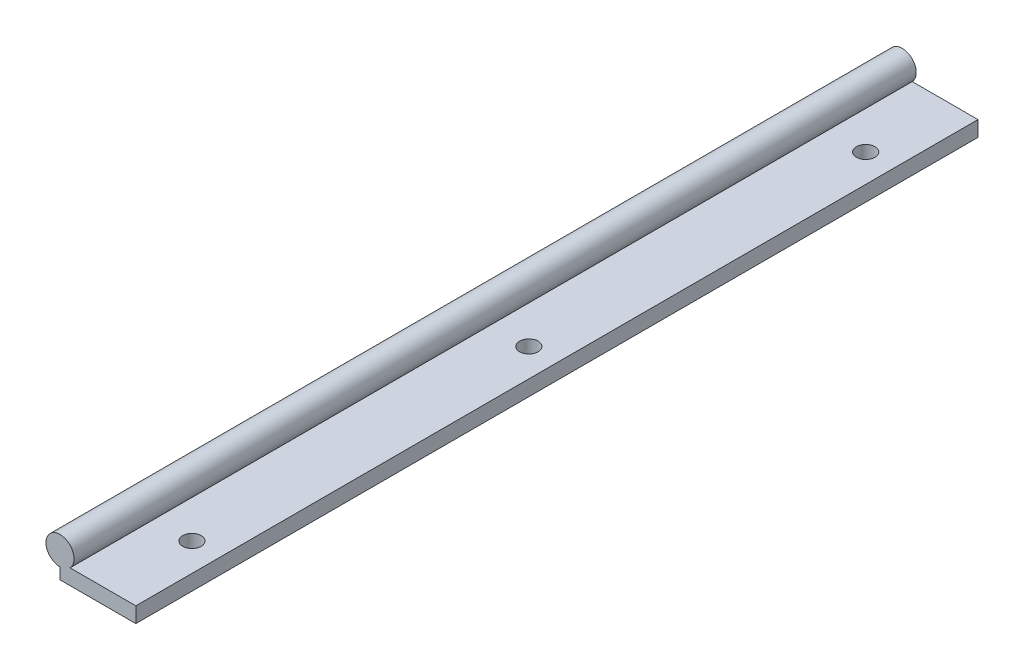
ISO-10303-21;
HEADER;
FILE_DESCRIPTION(('STEP AP214'),'2;1');
FILE_NAME('part.step','',(''),(''),'','','');
FILE_SCHEMA(('AUTOMOTIVE_DESIGN { 1 0 10303 214 1 1 1 1 }'));
ENDSEC;
DATA;
#1=APPLICATION_CONTEXT('core data for automotive mechanical design processes');
#2=APPLICATION_PROTOCOL_DEFINITION('international standard','automotive_design',2000,#1);
#3=PRODUCT_CONTEXT('',#1,'mechanical');
#4=PRODUCT('Part','Part','',(#3));
#5=PRODUCT_RELATED_PRODUCT_CATEGORY('part','',(#4));
#6=PRODUCT_DEFINITION_FORMATION('','',#4);
#7=PRODUCT_DEFINITION_CONTEXT('part definition',#1,'design');
#8=PRODUCT_DEFINITION('design','',#6,#7);
#9=PRODUCT_DEFINITION_SHAPE('','',#8);
#10=(LENGTH_UNIT() NAMED_UNIT(*) SI_UNIT(.MILLI.,.METRE.));
#11=(NAMED_UNIT(*) PLANE_ANGLE_UNIT() SI_UNIT($,.RADIAN.));
#12=(NAMED_UNIT(*) SI_UNIT($,.STERADIAN.) SOLID_ANGLE_UNIT());
#13=UNCERTAINTY_MEASURE_WITH_UNIT(LENGTH_MEASURE(1.E-05),#10,'distance_accuracy_value','');
#14=(GEOMETRIC_REPRESENTATION_CONTEXT(3) GLOBAL_UNCERTAINTY_ASSIGNED_CONTEXT((#13)) GLOBAL_UNIT_ASSIGNED_CONTEXT((#10,
#11,#12)) REPRESENTATION_CONTEXT('',''));
#15=CARTESIAN_POINT('',(0.,0.,0.));
#16=DIRECTION('',(0.,0.,1.));
#17=DIRECTION('',(1.,0.,0.));
#18=AXIS2_PLACEMENT_3D('',#15,#16,#17);
#19=CARTESIAN_POINT('',(13.5,2.75,300.));
#20=DIRECTION('',(-1.,0.,0.));
#21=DIRECTION('',(0.,0.,1.));
#22=AXIS2_PLACEMENT_3D('',#19,#20,#21);
#23=PLANE('',#22);
#24=DIRECTION('',(0.,1.,0.));
#25=VECTOR('',#24,1.);
#26=CARTESIAN_POINT('',(13.5,2.75,0.));
#27=LINE('',#26,#25);
#28=CARTESIAN_POINT('',(13.5,-2.75,0.));
#29=VERTEX_POINT('',#28);
#30=CARTESIAN_POINT('',(13.5,2.75,0.));
#31=VERTEX_POINT('',#30);
#32=EDGE_CURVE('E104',#29,#31,#27,.T.);
#33=ORIENTED_EDGE('',*,*,#32,.T.);
#34=DIRECTION('',(0.,0.,-1.));
#35=VECTOR('',#34,1.);
#36=CARTESIAN_POINT('',(13.5,2.75,300.));
#37=LINE('',#36,#35);
#38=CARTESIAN_POINT('',(13.5,2.75,300.));
#39=VERTEX_POINT('',#38);
#40=EDGE_CURVE('E11',#39,#31,#37,.T.);
#41=ORIENTED_EDGE('',*,*,#40,.F.);
#42=DIRECTION('',(0.,1.,0.));
#43=VECTOR('',#42,1.);
#44=CARTESIAN_POINT('',(13.5,2.75,300.));
#45=LINE('',#44,#43);
#46=CARTESIAN_POINT('',(13.5,-2.75,300.));
#47=VERTEX_POINT('',#46);
#48=EDGE_CURVE('E113',#47,#39,#45,.T.);
#49=ORIENTED_EDGE('',*,*,#48,.F.);
#50=DIRECTION('',(0.,0.,-1.));
#51=VECTOR('',#50,1.);
#52=CARTESIAN_POINT('',(13.5,-2.75,300.));
#53=LINE('',#52,#51);
#54=EDGE_CURVE('E100',#47,#29,#53,.T.);
#55=ORIENTED_EDGE('',*,*,#54,.T.);
#56=EDGE_LOOP('',(#33,#41,#49,#55));
#57=FACE_BOUND('',#56,.T.);
#58=ADVANCED_FACE('F30',(#57),#23,.F.);
#59=CARTESIAN_POINT('',(13.5,2.75,300.));
#60=DIRECTION('',(0.,-1.,0.));
#61=DIRECTION('',(1.,0.,0.));
#62=AXIS2_PLACEMENT_3D('',#59,#60,#61);
#63=PLANE('',#62);
#64=CARTESIAN_POINT('',(3.5,2.74999999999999,270.));
#65=DIRECTION('',(0.,1.,0.));
#66=DIRECTION('',(0.,0.,1.));
#67=AXIS2_PLACEMENT_3D('',#64,#65,#66);
#68=CIRCLE('',#67,3.29999999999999);
#69=CARTESIAN_POINT('',(3.5,2.74999999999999,273.3));
#70=VERTEX_POINT('',#69);
#71=EDGE_CURVE('E147',#70,#70,#68,.T.);
#72=ORIENTED_EDGE('',*,*,#71,.F.);
#73=EDGE_LOOP('',(#72));
#74=FACE_BOUND('',#73,.T.);
#75=CARTESIAN_POINT('',(3.5,2.74999999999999,150.));
#76=DIRECTION('',(0.,1.,0.));
#77=DIRECTION('',(0.,0.,1.));
#78=AXIS2_PLACEMENT_3D('',#75,#76,#77);
#79=CIRCLE('',#78,3.29999999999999);
#80=CARTESIAN_POINT('',(3.5,2.74999999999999,153.3));
#81=VERTEX_POINT('',#80);
#82=EDGE_CURVE('E151',#81,#81,#79,.T.);
#83=ORIENTED_EDGE('',*,*,#82,.F.);
#84=EDGE_LOOP('',(#83));
#85=FACE_BOUND('',#84,.T.);
#86=CARTESIAN_POINT('',(3.5,2.74999999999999,30.));
#87=DIRECTION('',(0.,1.,0.));
#88=DIRECTION('',(0.,0.,1.));
#89=AXIS2_PLACEMENT_3D('',#86,#87,#88);
#90=CIRCLE('',#89,3.29999999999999);
#91=CARTESIAN_POINT('',(3.5,2.74999999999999,33.3));
#92=VERTEX_POINT('',#91);
#93=EDGE_CURVE('E154',#92,#92,#90,.T.);
#94=ORIENTED_EDGE('',*,*,#93,.F.);
#95=EDGE_LOOP('',(#94));
#96=FACE_BOUND('',#95,.T.);
#97=DIRECTION('',(-1.,0.,0.));
#98=VECTOR('',#97,1.);
#99=CARTESIAN_POINT('',(13.5,2.75,0.));
#100=LINE('',#99,#98);
#101=CARTESIAN_POINT('',(-9.92928578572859,2.74999999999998,0.));
#102=VERTEX_POINT('',#101);
#103=EDGE_CURVE('E107',#31,#102,#100,.T.);
#104=ORIENTED_EDGE('',*,*,#103,.T.);
#105=DIRECTION('',(0.,0.,-1.));
#106=VECTOR('',#105,1.);
#107=CARTESIAN_POINT('',(-9.92928578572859,2.74999999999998,300.));
#108=LINE('',#107,#106);
#109=CARTESIAN_POINT('',(-9.92928578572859,2.74999999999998,300.));
#110=VERTEX_POINT('',#109);
#111=EDGE_CURVE('E38',#110,#102,#108,.T.);
#112=ORIENTED_EDGE('',*,*,#111,.F.);
#113=DIRECTION('',(-1.,0.,0.));
#114=VECTOR('',#113,1.);
#115=CARTESIAN_POINT('',(13.5,2.75,300.));
#116=LINE('',#115,#114);
#117=EDGE_CURVE('E80',#39,#110,#116,.T.);
#118=ORIENTED_EDGE('',*,*,#117,.F.);
#119=ORIENTED_EDGE('',*,*,#40,.T.);
#120=EDGE_LOOP('',(#104,#112,#118,#119));
#121=FACE_BOUND('',#120,.T.);
#122=ADVANCED_FACE('F135',(#74,#85,#96,#121),#63,.F.);
#123=CARTESIAN_POINT('',(-13.5,6.25,300.));
#124=DIRECTION('',(0.,0.,-1.));
#125=DIRECTION('',(-1.,0.,0.));
#126=AXIS2_PLACEMENT_3D('',#123,#124,#125);
#127=CYLINDRICAL_SURFACE('',#126,5.);
#128=CARTESIAN_POINT('',(-13.5,6.25,0.));
#129=DIRECTION('',(0.,0.,1.));
#130=DIRECTION('',(-1.,0.,0.));
#131=AXIS2_PLACEMENT_3D('',#128,#129,#130);
#132=CIRCLE('',#131,5.);
#133=CARTESIAN_POINT('',(-13.5,1.25,0.));
#134=VERTEX_POINT('',#133);
#135=EDGE_CURVE('E95',#102,#134,#132,.T.);
#136=ORIENTED_EDGE('',*,*,#135,.T.);
#137=DIRECTION('',(0.,0.,-1.));
#138=VECTOR('',#137,1.);
#139=CARTESIAN_POINT('',(-13.5,1.25,300.));
#140=LINE('',#139,#138);
#141=CARTESIAN_POINT('',(-13.5,1.25,300.));
#142=VERTEX_POINT('',#141);
#143=EDGE_CURVE('E92',#142,#134,#140,.T.);
#144=ORIENTED_EDGE('',*,*,#143,.F.);
#145=CARTESIAN_POINT('',(-13.5,6.25,300.));
#146=DIRECTION('',(0.,0.,1.));
#147=DIRECTION('',(-1.,0.,0.));
#148=AXIS2_PLACEMENT_3D('',#145,#146,#147);
#149=CIRCLE('',#148,5.);
#150=EDGE_CURVE('E84',#110,#142,#149,.T.);
#151=ORIENTED_EDGE('',*,*,#150,.F.);
#152=ORIENTED_EDGE('',*,*,#111,.T.);
#153=EDGE_LOOP('',(#136,#144,#151,#152));
#154=FACE_BOUND('',#153,.T.);
#155=ADVANCED_FACE('F93',(#154),#127,.T.);
#156=CARTESIAN_POINT('',(-13.5,1.25,300.));
#157=DIRECTION('',(1.,0.,0.));
#158=DIRECTION('',(0.,0.,-1.));
#159=AXIS2_PLACEMENT_3D('',#156,#157,#158);
#160=PLANE('',#159);
#161=DIRECTION('',(0.,-1.,0.));
#162=VECTOR('',#161,1.);
#163=CARTESIAN_POINT('',(-13.5,1.25,0.));
#164=LINE('',#163,#162);
#165=CARTESIAN_POINT('',(-13.5,-2.75000000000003,0.));
#166=VERTEX_POINT('',#165);
#167=EDGE_CURVE('E66',#134,#166,#164,.T.);
#168=ORIENTED_EDGE('',*,*,#167,.T.);
#169=DIRECTION('',(0.,0.,-1.));
#170=VECTOR('',#169,1.);
#171=CARTESIAN_POINT('',(-13.5,-2.75000000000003,300.));
#172=LINE('',#171,#170);
#173=CARTESIAN_POINT('',(-13.5,-2.75000000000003,300.));
#174=VERTEX_POINT('',#173);
#175=EDGE_CURVE('E96',#174,#166,#172,.T.);
#176=ORIENTED_EDGE('',*,*,#175,.F.);
#177=DIRECTION('',(0.,-1.,0.));
#178=VECTOR('',#177,1.);
#179=CARTESIAN_POINT('',(-13.5,1.25,300.));
#180=LINE('',#179,#178);
#181=EDGE_CURVE('E88',#142,#174,#180,.T.);
#182=ORIENTED_EDGE('',*,*,#181,.F.);
#183=ORIENTED_EDGE('',*,*,#143,.T.);
#184=EDGE_LOOP('',(#168,#176,#182,#183));
#185=FACE_BOUND('',#184,.T.);
#186=ADVANCED_FACE('F98',(#185),#160,.F.);
#187=CARTESIAN_POINT('',(13.5,-2.75,300.));
#188=DIRECTION('',(0.,1.,0.));
#189=DIRECTION('',(-1.,0.,0.));
#190=AXIS2_PLACEMENT_3D('',#187,#188,#189);
#191=PLANE('',#190);
#192=CARTESIAN_POINT('',(3.5,-2.75000000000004,270.));
#193=DIRECTION('',(0.,1.,0.));
#194=DIRECTION('',(0.,0.,1.));
#195=AXIS2_PLACEMENT_3D('',#192,#193,#194);
#196=CIRCLE('',#195,3.3);
#197=CARTESIAN_POINT('',(3.5,-2.75000000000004,273.3));
#198=VERTEX_POINT('',#197);
#199=EDGE_CURVE('E165',#198,#198,#196,.T.);
#200=ORIENTED_EDGE('',*,*,#199,.T.);
#201=EDGE_LOOP('',(#200));
#202=FACE_BOUND('',#201,.T.);
#203=CARTESIAN_POINT('',(3.5,-2.75000000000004,150.));
#204=DIRECTION('',(0.,1.,0.));
#205=DIRECTION('',(0.,0.,1.));
#206=AXIS2_PLACEMENT_3D('',#203,#204,#205);
#207=CIRCLE('',#206,3.3);
#208=CARTESIAN_POINT('',(3.5,-2.75000000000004,153.3));
#209=VERTEX_POINT('',#208);
#210=EDGE_CURVE('E156',#209,#209,#207,.T.);
#211=ORIENTED_EDGE('',*,*,#210,.T.);
#212=EDGE_LOOP('',(#211));
#213=FACE_BOUND('',#212,.T.);
#214=CARTESIAN_POINT('',(3.5,-2.75000000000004,30.));
#215=DIRECTION('',(0.,1.,0.));
#216=DIRECTION('',(0.,0.,1.));
#217=AXIS2_PLACEMENT_3D('',#214,#215,#216);
#218=CIRCLE('',#217,3.3);
#219=CARTESIAN_POINT('',(3.5,-2.75000000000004,33.3));
#220=VERTEX_POINT('',#219);
#221=EDGE_CURVE('E108',#220,#220,#218,.T.);
#222=ORIENTED_EDGE('',*,*,#221,.T.);
#223=EDGE_LOOP('',(#222));
#224=FACE_BOUND('',#223,.T.);
#225=DIRECTION('',(1.,0.,0.));
#226=VECTOR('',#225,1.);
#227=CARTESIAN_POINT('',(13.5,-2.75,0.));
#228=LINE('',#227,#226);
#229=EDGE_CURVE('E72',#166,#29,#228,.T.);
#230=ORIENTED_EDGE('',*,*,#229,.T.);
#231=ORIENTED_EDGE('',*,*,#54,.F.);
#232=DIRECTION('',(1.,0.,0.));
#233=VECTOR('',#232,1.);
#234=CARTESIAN_POINT('',(13.5,-2.75,300.));
#235=LINE('',#234,#233);
#236=EDGE_CURVE('E46',#174,#47,#235,.T.);
#237=ORIENTED_EDGE('',*,*,#236,.F.);
#238=ORIENTED_EDGE('',*,*,#175,.T.);
#239=EDGE_LOOP('',(#230,#231,#237,#238));
#240=FACE_BOUND('',#239,.T.);
#241=ADVANCED_FACE('F121',(#202,#213,#224,#240),#191,.F.);
#242=CARTESIAN_POINT('',(-13.5,6.25,300.));
#243=DIRECTION('',(0.,0.,-1.));
#244=DIRECTION('',(-1.,0.,0.));
#245=AXIS2_PLACEMENT_3D('',#242,#243,#244);
#246=PLANE('',#245);
#247=ORIENTED_EDGE('',*,*,#48,.T.);
#248=ORIENTED_EDGE('',*,*,#117,.T.);
#249=ORIENTED_EDGE('',*,*,#150,.T.);
#250=ORIENTED_EDGE('',*,*,#181,.T.);
#251=ORIENTED_EDGE('',*,*,#236,.T.);
#252=EDGE_LOOP('',(#247,#248,#249,#250,#251));
#253=FACE_BOUND('',#252,.T.);
#254=ADVANCED_FACE('F86',(#253),#246,.F.);
#255=CARTESIAN_POINT('',(-13.5,6.25,0.));
#256=DIRECTION('',(0.,0.,-1.));
#257=DIRECTION('',(-1.,0.,0.));
#258=AXIS2_PLACEMENT_3D('',#255,#256,#257);
#259=PLANE('',#258);
#260=ORIENTED_EDGE('',*,*,#32,.F.);
#261=ORIENTED_EDGE('',*,*,#229,.F.);
#262=ORIENTED_EDGE('',*,*,#167,.F.);
#263=ORIENTED_EDGE('',*,*,#135,.F.);
#264=ORIENTED_EDGE('',*,*,#103,.F.);
#265=EDGE_LOOP('',(#260,#261,#262,#263,#264));
#266=FACE_BOUND('',#265,.T.);
#267=ADVANCED_FACE('F117',(#266),#259,.T.);
#268=CARTESIAN_POINT('',(3.5,2.74999999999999,30.));
#269=DIRECTION('',(0.,1.,0.));
#270=DIRECTION('',(0.,0.,1.));
#271=AXIS2_PLACEMENT_3D('',#268,#269,#270);
#272=CYLINDRICAL_SURFACE('',#271,3.29999999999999);
#273=ORIENTED_EDGE('',*,*,#221,.F.);
#274=EDGE_LOOP('',(#273));
#275=FACE_BOUND('',#274,.T.);
#276=ORIENTED_EDGE('',*,*,#93,.T.);
#277=EDGE_LOOP('',(#276));
#278=FACE_BOUND('',#277,.T.);
#279=ADVANCED_FACE('F176',(#275,#278),#272,.F.);
#280=CARTESIAN_POINT('',(3.5,2.74999999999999,150.));
#281=DIRECTION('',(0.,1.,0.));
#282=DIRECTION('',(0.,0.,1.));
#283=AXIS2_PLACEMENT_3D('',#280,#281,#282);
#284=CYLINDRICAL_SURFACE('',#283,3.29999999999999);
#285=ORIENTED_EDGE('',*,*,#210,.F.);
#286=EDGE_LOOP('',(#285));
#287=FACE_BOUND('',#286,.T.);
#288=ORIENTED_EDGE('',*,*,#82,.T.);
#289=EDGE_LOOP('',(#288));
#290=FACE_BOUND('',#289,.T.);
#291=ADVANCED_FACE('F170',(#287,#290),#284,.F.);
#292=CARTESIAN_POINT('',(3.5,2.74999999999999,270.));
#293=DIRECTION('',(0.,1.,0.));
#294=DIRECTION('',(0.,0.,1.));
#295=AXIS2_PLACEMENT_3D('',#292,#293,#294);
#296=CYLINDRICAL_SURFACE('',#295,3.29999999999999);
#297=ORIENTED_EDGE('',*,*,#199,.F.);
#298=EDGE_LOOP('',(#297));
#299=FACE_BOUND('',#298,.T.);
#300=ORIENTED_EDGE('',*,*,#71,.T.);
#301=EDGE_LOOP('',(#300));
#302=FACE_BOUND('',#301,.T.);
#303=ADVANCED_FACE('F168',(#299,#302),#296,.F.);
#304=CLOSED_SHELL('',(#58,#122,#155,#186,#241,#254,#267,#279,#291,#303));
#305=MANIFOLD_SOLID_BREP('B2',#304);
#306=ADVANCED_BREP_SHAPE_REPRESENTATION('',(#18,#305),#14);
#307=SHAPE_DEFINITION_REPRESENTATION(#9,#306);
ENDSEC;
END-ISO-10303-21;
